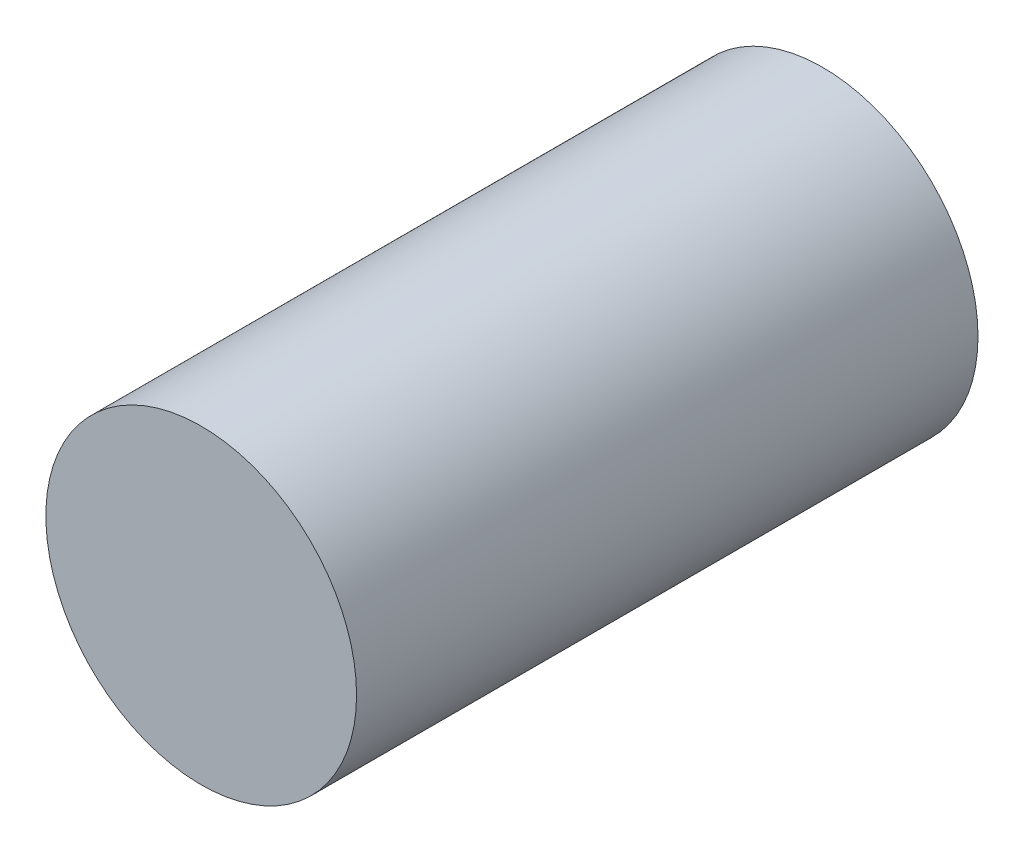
from build123d import *

# Parameters (mm, degrees)
SKETCH1_R           = 10
BOSS_EXTRUDE1_DEPTH = 40


with BuildPart() as part:
    # Sketch1 → Boss-Extrude1 (new body)
    with BuildSketch(Plane.XY):
        Circle(SKETCH1_R)
    extrude(amount=BOSS_EXTRUDE1_DEPTH)


solid = part.part
